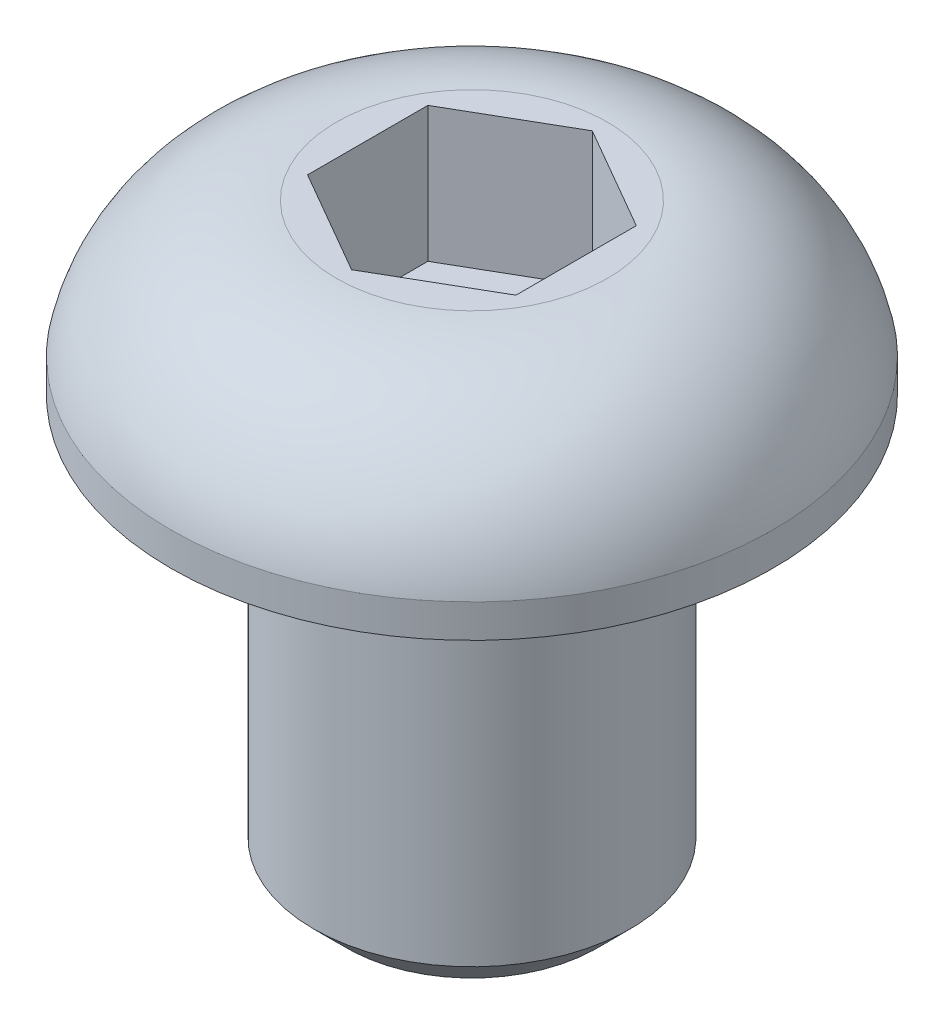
ISO-10303-21;
HEADER;
FILE_DESCRIPTION(('STEP AP214'),'2;1');
FILE_NAME('part.step','',(''),(''),'','','');
FILE_SCHEMA(('AUTOMOTIVE_DESIGN { 1 0 10303 214 1 1 1 1 }'));
ENDSEC;
DATA;
#1=APPLICATION_CONTEXT('core data for automotive mechanical design processes');
#2=APPLICATION_PROTOCOL_DEFINITION('international standard','automotive_design',2000,#1);
#3=PRODUCT_CONTEXT('',#1,'mechanical');
#4=PRODUCT('Part','Part','',(#3));
#5=PRODUCT_RELATED_PRODUCT_CATEGORY('part','',(#4));
#6=PRODUCT_DEFINITION_FORMATION('','',#4);
#7=PRODUCT_DEFINITION_CONTEXT('part definition',#1,'design');
#8=PRODUCT_DEFINITION('design','',#6,#7);
#9=PRODUCT_DEFINITION_SHAPE('','',#8);
#10=(LENGTH_UNIT() NAMED_UNIT(*) SI_UNIT(.MILLI.,.METRE.));
#11=(NAMED_UNIT(*) PLANE_ANGLE_UNIT() SI_UNIT($,.RADIAN.));
#12=(NAMED_UNIT(*) SI_UNIT($,.STERADIAN.) SOLID_ANGLE_UNIT());
#13=UNCERTAINTY_MEASURE_WITH_UNIT(LENGTH_MEASURE(1.E-05),#10,'distance_accuracy_value','');
#14=(GEOMETRIC_REPRESENTATION_CONTEXT(3) GLOBAL_UNCERTAINTY_ASSIGNED_CONTEXT((#13)) GLOBAL_UNIT_ASSIGNED_CONTEXT((#10,
#11,#12)) REPRESENTATION_CONTEXT('',''));
#15=CARTESIAN_POINT('',(0.,0.,0.));
#16=DIRECTION('',(0.,0.,1.));
#17=DIRECTION('',(1.,0.,0.));
#18=AXIS2_PLACEMENT_3D('',#15,#16,#17);
#19=CARTESIAN_POINT('',(0.,0.,0.));
#20=DIRECTION('',(0.,1.,0.));
#21=DIRECTION('',(0.,0.,1.));
#22=AXIS2_PLACEMENT_3D('',#19,#20,#21);
#23=PLANE('',#22);
#24=DIRECTION('',(0.,0.,1.));
#25=VECTOR('',#24,1.);
#26=CARTESIAN_POINT('',(-1.5875,0.,-0.91654355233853));
#27=LINE('',#26,#25);
#28=CARTESIAN_POINT('',(-1.5875,0.,-0.91654355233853));
#29=VERTEX_POINT('',#28);
#30=CARTESIAN_POINT('',(-1.5875,0.,0.91654355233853));
#31=VERTEX_POINT('',#30);
#32=EDGE_CURVE('E52',#29,#31,#27,.T.);
#33=ORIENTED_EDGE('',*,*,#32,.F.);
#34=DIRECTION('',(-0.866025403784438,0.,0.5));
#35=VECTOR('',#34,1.);
#36=CARTESIAN_POINT('',(0.,0.,-1.83308710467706));
#37=LINE('',#36,#35);
#38=CARTESIAN_POINT('',(0.,0.,-1.83308710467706));
#39=VERTEX_POINT('',#38);
#40=EDGE_CURVE('E137',#39,#29,#37,.T.);
#41=ORIENTED_EDGE('',*,*,#40,.F.);
#42=DIRECTION('',(0.866025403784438,0.,0.5));
#43=VECTOR('',#42,1.);
#44=CARTESIAN_POINT('',(0.,0.,-1.83308710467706));
#45=LINE('',#44,#43);
#46=CARTESIAN_POINT('',(1.5875,0.,-0.91654355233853));
#47=VERTEX_POINT('',#46);
#48=EDGE_CURVE('E135',#39,#47,#45,.T.);
#49=ORIENTED_EDGE('',*,*,#48,.T.);
#50=DIRECTION('',(0.,0.,1.));
#51=VECTOR('',#50,1.);
#52=CARTESIAN_POINT('',(1.5875,0.,-0.91654355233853));
#53=LINE('',#52,#51);
#54=CARTESIAN_POINT('',(1.5875,0.,0.916543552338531));
#55=VERTEX_POINT('',#54);
#56=EDGE_CURVE('E111',#47,#55,#53,.T.);
#57=ORIENTED_EDGE('',*,*,#56,.T.);
#58=DIRECTION('',(0.866025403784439,0.,-0.5));
#59=VECTOR('',#58,1.);
#60=CARTESIAN_POINT('',(0.,0.,1.83308710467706));
#61=LINE('',#60,#59);
#62=CARTESIAN_POINT('',(0.,0.,1.83308710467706));
#63=VERTEX_POINT('',#62);
#64=EDGE_CURVE('E131',#63,#55,#61,.T.);
#65=ORIENTED_EDGE('',*,*,#64,.F.);
#66=DIRECTION('',(-0.866025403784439,0.,-0.5));
#67=VECTOR('',#66,1.);
#68=CARTESIAN_POINT('',(0.,0.,1.83308710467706));
#69=LINE('',#68,#67);
#70=EDGE_CURVE('E127',#63,#31,#69,.T.);
#71=ORIENTED_EDGE('',*,*,#70,.T.);
#72=EDGE_LOOP('',(#33,#41,#49,#57,#65,#71));
#73=FACE_BOUND('',#72,.T.);
#74=CARTESIAN_POINT('',(0.,0.,0.));
#75=DIRECTION('',(0.,1.,0.));
#76=DIRECTION('',(0.,0.,1.));
#77=AXIS2_PLACEMENT_3D('',#74,#75,#76);
#78=CIRCLE('',#77,2.06375);
#79=CARTESIAN_POINT('',(0.,0.,2.06375));
#80=VERTEX_POINT('',#79);
#81=EDGE_CURVE('E155',#80,#80,#78,.T.);
#82=ORIENTED_EDGE('',*,*,#81,.T.);
#83=EDGE_LOOP('',(#82));
#84=FACE_BOUND('',#83,.T.);
#85=ADVANCED_FACE('F37',(#73,#84),#23,.T.);
#86=CARTESIAN_POINT('',(0.,-2.57317091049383,0.));
#87=DIRECTION('',(0.,1.,0.));
#88=DIRECTION('',(0.,0.,1.));
#89=AXIS2_PLACEMENT_3D('',#86,#87,#88);
#90=DEGENERATE_TOROIDAL_SURFACE('',#89,2.06375,2.57317091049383,.T.);
#91=CARTESIAN_POINT('',(0.,-2.0574,0.));
#92=DIRECTION('',(0.,1.,0.));
#93=DIRECTION('',(0.,0.,1.));
#94=AXIS2_PLACEMENT_3D('',#91,#92,#93);
#95=CIRCLE('',#94,4.5847);
#96=CARTESIAN_POINT('',(0.,-2.0574,4.5847));
#97=VERTEX_POINT('',#96);
#98=EDGE_CURVE('E152',#97,#97,#95,.T.);
#99=ORIENTED_EDGE('',*,*,#98,.T.);
#100=EDGE_LOOP('',(#99));
#101=FACE_BOUND('',#100,.T.);
#102=ORIENTED_EDGE('',*,*,#81,.F.);
#103=EDGE_LOOP('',(#102));
#104=FACE_BOUND('',#103,.T.);
#105=ADVANCED_FACE('F176',(#101,#104),#90,.T.);
#106=CARTESIAN_POINT('',(0.,25.4,0.));
#107=DIRECTION('',(0.,1.,0.));
#108=DIRECTION('',(0.,0.,1.));
#109=AXIS2_PLACEMENT_3D('',#106,#107,#108);
#110=CYLINDRICAL_SURFACE('',#109,4.5847);
#111=CARTESIAN_POINT('',(0.,-2.5654,0.));
#112=DIRECTION('',(0.,1.,0.));
#113=DIRECTION('',(0.,0.,1.));
#114=AXIS2_PLACEMENT_3D('',#111,#112,#113);
#115=CIRCLE('',#114,4.5847);
#116=CARTESIAN_POINT('',(0.,-2.5654,4.5847));
#117=VERTEX_POINT('',#116);
#118=EDGE_CURVE('E149',#117,#117,#115,.T.);
#119=ORIENTED_EDGE('',*,*,#118,.T.);
#120=EDGE_LOOP('',(#119));
#121=FACE_BOUND('',#120,.T.);
#122=ORIENTED_EDGE('',*,*,#98,.F.);
#123=EDGE_LOOP('',(#122));
#124=FACE_BOUND('',#123,.T.);
#125=ADVANCED_FACE('F181',(#121,#124),#110,.T.);
#126=CARTESIAN_POINT('',(2.413,-2.5654,0.));
#127=DIRECTION('',(0.,1.,0.));
#128=DIRECTION('',(0.,0.,1.));
#129=AXIS2_PLACEMENT_3D('',#126,#127,#128);
#130=PLANE('',#129);
#131=ORIENTED_EDGE('',*,*,#118,.F.);
#132=EDGE_LOOP('',(#131));
#133=FACE_BOUND('',#132,.T.);
#134=CARTESIAN_POINT('',(0.,-2.5654,0.));
#135=DIRECTION('',(0.,1.,0.));
#136=DIRECTION('',(0.,0.,1.));
#137=AXIS2_PLACEMENT_3D('',#134,#135,#136);
#138=CIRCLE('',#137,2.413);
#139=CARTESIAN_POINT('',(0.,-2.5654,2.413));
#140=VERTEX_POINT('',#139);
#141=EDGE_CURVE('E141',#140,#140,#138,.T.);
#142=ORIENTED_EDGE('',*,*,#141,.T.);
#143=EDGE_LOOP('',(#142));
#144=FACE_BOUND('',#143,.T.);
#145=ADVANCED_FACE('F188',(#133,#144),#130,.F.);
#146=CARTESIAN_POINT('',(0.,25.4,0.));
#147=DIRECTION('',(0.,1.,0.));
#148=DIRECTION('',(0.,0.,1.));
#149=AXIS2_PLACEMENT_3D('',#146,#147,#148);
#150=CYLINDRICAL_SURFACE('',#149,2.413);
#151=CARTESIAN_POINT('',(0.,-8.40739999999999,0.));
#152=DIRECTION('',(0.,-1.,0.));
#153=DIRECTION('',(0.,0.,-1.));
#154=AXIS2_PLACEMENT_3D('',#151,#152,#153);
#155=CIRCLE('',#154,2.413);
#156=CARTESIAN_POINT('',(0.,-8.40739999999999,-2.413));
#157=VERTEX_POINT('',#156);
#158=EDGE_CURVE('E45',#157,#157,#155,.F.);
#159=ORIENTED_EDGE('',*,*,#158,.T.);
#160=EDGE_LOOP('',(#159));
#161=FACE_BOUND('',#160,.T.);
#162=ORIENTED_EDGE('',*,*,#141,.F.);
#163=EDGE_LOOP('',(#162));
#164=FACE_BOUND('',#163,.T.);
#165=ADVANCED_FACE('F163',(#161,#164),#150,.T.);
#166=CARTESIAN_POINT('',(2.413,-8.9154,0.));
#167=DIRECTION('',(0.,-1.,0.));
#168=DIRECTION('',(0.,0.,-1.));
#169=AXIS2_PLACEMENT_3D('',#166,#167,#168);
#170=PLANE('',#169);
#171=CARTESIAN_POINT('',(0.,-8.9154,0.));
#172=DIRECTION('',(0.,-1.,0.));
#173=DIRECTION('',(0.,0.,-1.));
#174=AXIS2_PLACEMENT_3D('',#171,#172,#173);
#175=CIRCLE('',#174,1.90499999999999);
#176=CARTESIAN_POINT('',(0.,-8.9154,-1.90499999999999));
#177=VERTEX_POINT('',#176);
#178=EDGE_CURVE('E11',#177,#177,#175,.T.);
#179=ORIENTED_EDGE('',*,*,#178,.T.);
#180=EDGE_LOOP('',(#179));
#181=FACE_BOUND('',#180,.T.);
#182=CARTESIAN_POINT('',(0.,-8.9154,0.));
#183=DIRECTION('',(0.,-1.,0.));
#184=DIRECTION('',(0.,0.,-1.));
#185=AXIS2_PLACEMENT_3D('',#182,#183,#184);
#186=CIRCLE('',#185,1.1811);
#187=CARTESIAN_POINT('',(0.,-8.9154,-1.1811));
#188=VERTEX_POINT('',#187);
#189=EDGE_CURVE('E159',#188,#188,#186,.T.);
#190=ORIENTED_EDGE('',*,*,#189,.F.);
#191=EDGE_LOOP('',(#190));
#192=FACE_BOUND('',#191,.T.);
#193=ADVANCED_FACE('F195',(#181,#192),#170,.T.);
#194=CARTESIAN_POINT('',(-1.5875,-2.0574,-0.91654355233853));
#195=DIRECTION('',(-1.,0.,0.));
#196=DIRECTION('',(0.,0.,1.));
#197=AXIS2_PLACEMENT_3D('',#194,#195,#196);
#198=PLANE('',#197);
#199=ORIENTED_EDGE('',*,*,#32,.T.);
#200=DIRECTION('',(0.,1.,0.));
#201=VECTOR('',#200,1.);
#202=CARTESIAN_POINT('',(-1.5875,-2.0574,0.91654355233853));
#203=LINE('',#202,#201);
#204=CARTESIAN_POINT('',(-1.5875,-2.0574,0.91654355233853));
#205=VERTEX_POINT('',#204);
#206=EDGE_CURVE('E125',#205,#31,#203,.T.);
#207=ORIENTED_EDGE('',*,*,#206,.F.);
#208=DIRECTION('',(0.,0.,1.));
#209=VECTOR('',#208,1.);
#210=CARTESIAN_POINT('',(-1.5875,-2.0574,-0.91654355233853));
#211=LINE('',#210,#209);
#212=CARTESIAN_POINT('',(-1.5875,-2.0574,-0.91654355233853));
#213=VERTEX_POINT('',#212);
#214=EDGE_CURVE('E139',#213,#205,#211,.T.);
#215=ORIENTED_EDGE('',*,*,#214,.F.);
#216=DIRECTION('',(0.,1.,0.));
#217=VECTOR('',#216,1.);
#218=CARTESIAN_POINT('',(-1.5875,-2.0574,-0.91654355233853));
#219=LINE('',#218,#217);
#220=EDGE_CURVE('E60',#213,#29,#219,.T.);
#221=ORIENTED_EDGE('',*,*,#220,.T.);
#222=EDGE_LOOP('',(#199,#207,#215,#221));
#223=FACE_BOUND('',#222,.T.);
#224=ADVANCED_FACE('F198',(#223),#198,.F.);
#225=CARTESIAN_POINT('',(0.,-2.0574,-1.83308710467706));
#226=DIRECTION('',(-0.5,0.,-0.866025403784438));
#227=DIRECTION('',(-0.866025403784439,0.,0.5));
#228=AXIS2_PLACEMENT_3D('',#225,#226,#227);
#229=PLANE('',#228);
#230=ORIENTED_EDGE('',*,*,#40,.T.);
#231=ORIENTED_EDGE('',*,*,#220,.F.);
#232=DIRECTION('',(-0.866025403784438,0.,0.5));
#233=VECTOR('',#232,1.);
#234=CARTESIAN_POINT('',(0.,-2.0574,-1.83308710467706));
#235=LINE('',#234,#233);
#236=CARTESIAN_POINT('',(0.,-2.0574,-1.83308710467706));
#237=VERTEX_POINT('',#236);
#238=EDGE_CURVE('E104',#237,#213,#235,.T.);
#239=ORIENTED_EDGE('',*,*,#238,.F.);
#240=DIRECTION('',(0.,1.,0.));
#241=VECTOR('',#240,1.);
#242=CARTESIAN_POINT('',(0.,-2.0574,-1.83308710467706));
#243=LINE('',#242,#241);
#244=EDGE_CURVE('E100',#237,#39,#243,.T.);
#245=ORIENTED_EDGE('',*,*,#244,.T.);
#246=EDGE_LOOP('',(#230,#231,#239,#245));
#247=FACE_BOUND('',#246,.T.);
#248=ADVANCED_FACE('F202',(#247),#229,.F.);
#249=CARTESIAN_POINT('',(0.,-2.0574,-1.83308710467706));
#250=DIRECTION('',(-0.5,0.,0.866025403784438));
#251=DIRECTION('',(0.866025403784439,0.,0.5));
#252=AXIS2_PLACEMENT_3D('',#249,#250,#251);
#253=PLANE('',#252);
#254=ORIENTED_EDGE('',*,*,#48,.F.);
#255=ORIENTED_EDGE('',*,*,#244,.F.);
#256=DIRECTION('',(0.866025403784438,0.,0.5));
#257=VECTOR('',#256,1.);
#258=CARTESIAN_POINT('',(0.,-2.0574,-1.83308710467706));
#259=LINE('',#258,#257);
#260=CARTESIAN_POINT('',(1.5875,-2.0574,-0.91654355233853));
#261=VERTEX_POINT('',#260);
#262=EDGE_CURVE('E94',#237,#261,#259,.T.);
#263=ORIENTED_EDGE('',*,*,#262,.T.);
#264=DIRECTION('',(0.,1.,0.));
#265=VECTOR('',#264,1.);
#266=CARTESIAN_POINT('',(1.5875,-2.0574,-0.91654355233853));
#267=LINE('',#266,#265);
#268=EDGE_CURVE('E98',#261,#47,#267,.T.);
#269=ORIENTED_EDGE('',*,*,#268,.T.);
#270=EDGE_LOOP('',(#254,#255,#263,#269));
#271=FACE_BOUND('',#270,.T.);
#272=ADVANCED_FACE('F97',(#271),#253,.T.);
#273=CARTESIAN_POINT('',(1.5875,-2.0574,-0.91654355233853));
#274=DIRECTION('',(-1.,0.,0.));
#275=DIRECTION('',(0.,0.,1.));
#276=AXIS2_PLACEMENT_3D('',#273,#274,#275);
#277=PLANE('',#276);
#278=ORIENTED_EDGE('',*,*,#56,.F.);
#279=ORIENTED_EDGE('',*,*,#268,.F.);
#280=DIRECTION('',(0.,0.,1.));
#281=VECTOR('',#280,1.);
#282=CARTESIAN_POINT('',(1.5875,-2.0574,-0.91654355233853));
#283=LINE('',#282,#281);
#284=CARTESIAN_POINT('',(1.5875,-2.0574,0.916543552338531));
#285=VERTEX_POINT('',#284);
#286=EDGE_CURVE('E105',#261,#285,#283,.T.);
#287=ORIENTED_EDGE('',*,*,#286,.T.);
#288=DIRECTION('',(0.,1.,0.));
#289=VECTOR('',#288,1.);
#290=CARTESIAN_POINT('',(1.5875,-2.0574,0.916543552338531));
#291=LINE('',#290,#289);
#292=EDGE_CURVE('E113',#285,#55,#291,.T.);
#293=ORIENTED_EDGE('',*,*,#292,.T.);
#294=EDGE_LOOP('',(#278,#279,#287,#293));
#295=FACE_BOUND('',#294,.T.);
#296=ADVANCED_FACE('F108',(#295),#277,.T.);
#297=CARTESIAN_POINT('',(0.,-2.0574,1.83308710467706));
#298=DIRECTION('',(0.5,0.,0.866025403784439));
#299=DIRECTION('',(0.866025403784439,0.,-0.5));
#300=AXIS2_PLACEMENT_3D('',#297,#298,#299);
#301=PLANE('',#300);
#302=ORIENTED_EDGE('',*,*,#64,.T.);
#303=ORIENTED_EDGE('',*,*,#292,.F.);
#304=DIRECTION('',(0.866025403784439,0.,-0.5));
#305=VECTOR('',#304,1.);
#306=CARTESIAN_POINT('',(0.,-2.0574,1.83308710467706));
#307=LINE('',#306,#305);
#308=CARTESIAN_POINT('',(0.,-2.0574,1.83308710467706));
#309=VERTEX_POINT('',#308);
#310=EDGE_CURVE('E119',#309,#285,#307,.T.);
#311=ORIENTED_EDGE('',*,*,#310,.F.);
#312=DIRECTION('',(0.,1.,0.));
#313=VECTOR('',#312,1.);
#314=CARTESIAN_POINT('',(0.,-2.0574,1.83308710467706));
#315=LINE('',#314,#313);
#316=EDGE_CURVE('E144',#309,#63,#315,.T.);
#317=ORIENTED_EDGE('',*,*,#316,.T.);
#318=EDGE_LOOP('',(#302,#303,#311,#317));
#319=FACE_BOUND('',#318,.T.);
#320=ADVANCED_FACE('F206',(#319),#301,.F.);
#321=CARTESIAN_POINT('',(0.,-2.0574,1.83308710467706));
#322=DIRECTION('',(0.5,0.,-0.866025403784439));
#323=DIRECTION('',(-0.866025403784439,0.,-0.5));
#324=AXIS2_PLACEMENT_3D('',#321,#322,#323);
#325=PLANE('',#324);
#326=ORIENTED_EDGE('',*,*,#70,.F.);
#327=ORIENTED_EDGE('',*,*,#316,.F.);
#328=DIRECTION('',(-0.866025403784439,0.,-0.5));
#329=VECTOR('',#328,1.);
#330=CARTESIAN_POINT('',(0.,-2.0574,1.83308710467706));
#331=LINE('',#330,#329);
#332=EDGE_CURVE('E86',#309,#205,#331,.T.);
#333=ORIENTED_EDGE('',*,*,#332,.T.);
#334=ORIENTED_EDGE('',*,*,#206,.T.);
#335=EDGE_LOOP('',(#326,#327,#333,#334));
#336=FACE_BOUND('',#335,.T.);
#337=ADVANCED_FACE('F203',(#336),#325,.T.);
#338=CARTESIAN_POINT('',(-1.5875,-2.0574,2.74963065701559));
#339=DIRECTION('',(0.,1.,0.));
#340=DIRECTION('',(0.,0.,1.));
#341=AXIS2_PLACEMENT_3D('',#338,#339,#340);
#342=PLANE('',#341);
#343=CARTESIAN_POINT('',(0.,-2.0574,0.));
#344=DIRECTION('',(0.,1.,0.));
#345=DIRECTION('',(0.,0.,1.));
#346=AXIS2_PLACEMENT_3D('',#343,#344,#345);
#347=CIRCLE('',#346,1.1811);
#348=CARTESIAN_POINT('',(0.,-2.0574,1.1811));
#349=VERTEX_POINT('',#348);
#350=EDGE_CURVE('E128',#349,#349,#347,.T.);
#351=ORIENTED_EDGE('',*,*,#350,.F.);
#352=EDGE_LOOP('',(#351));
#353=FACE_BOUND('',#352,.T.);
#354=ORIENTED_EDGE('',*,*,#214,.T.);
#355=ORIENTED_EDGE('',*,*,#332,.F.);
#356=ORIENTED_EDGE('',*,*,#310,.T.);
#357=ORIENTED_EDGE('',*,*,#286,.F.);
#358=ORIENTED_EDGE('',*,*,#262,.F.);
#359=ORIENTED_EDGE('',*,*,#238,.T.);
#360=EDGE_LOOP('',(#354,#355,#356,#357,#358,#359));
#361=FACE_BOUND('',#360,.T.);
#362=ADVANCED_FACE('F117',(#353,#361),#342,.T.);
#363=CARTESIAN_POINT('',(0.,0.,0.));
#364=DIRECTION('',(0.,-1.,0.));
#365=DIRECTION('',(0.,0.,-1.));
#366=AXIS2_PLACEMENT_3D('',#363,#364,#365);
#367=CYLINDRICAL_SURFACE('',#366,1.1811);
#368=ORIENTED_EDGE('',*,*,#350,.T.);
#369=EDGE_LOOP('',(#368));
#370=FACE_BOUND('',#369,.T.);
#371=ORIENTED_EDGE('',*,*,#189,.T.);
#372=EDGE_LOOP('',(#371));
#373=FACE_BOUND('',#372,.T.);
#374=ADVANCED_FACE('F167',(#370,#373),#367,.F.);
#375=CARTESIAN_POINT('',(0.,-8.40739999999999,0.));
#376=DIRECTION('',(0.,1.,0.));
#377=DIRECTION('',(0.,0.,1.));
#378=AXIS2_PLACEMENT_3D('',#375,#376,#377);
#379=CONICAL_SURFACE('',#378,2.413,0.785398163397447);
#380=ORIENTED_EDGE('',*,*,#178,.F.);
#381=EDGE_LOOP('',(#380));
#382=FACE_BOUND('',#381,.T.);
#383=ORIENTED_EDGE('',*,*,#158,.F.);
#384=EDGE_LOOP('',(#383));
#385=FACE_BOUND('',#384,.T.);
#386=ADVANCED_FACE('F39',(#382,#385),#379,.T.);
#387=CLOSED_SHELL('',(#85,#105,#125,#145,#165,#193,#224,#248,#272,#296,#320,#337,#362,#374,#386));
#388=MANIFOLD_SOLID_BREP('B2',#387);
#389=ADVANCED_BREP_SHAPE_REPRESENTATION('',(#18,#388),#14);
#390=SHAPE_DEFINITION_REPRESENTATION(#9,#389);
ENDSEC;
END-ISO-10303-21;
